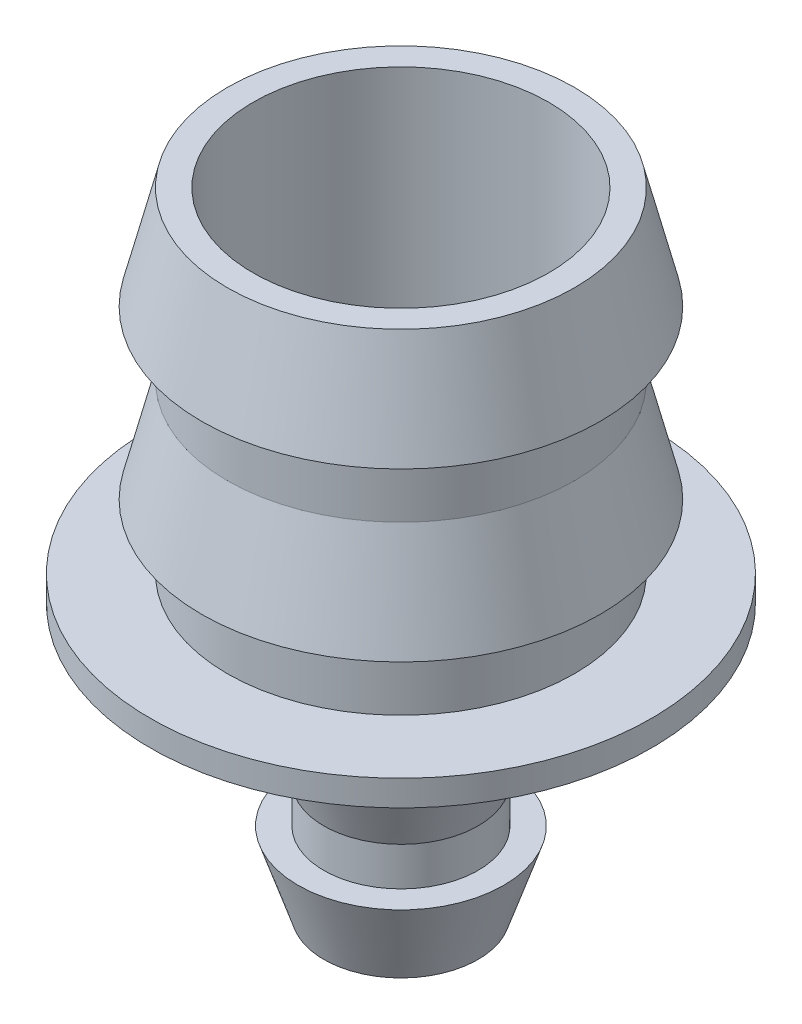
ISO-10303-21;
HEADER;
FILE_DESCRIPTION(('STEP AP214'),'2;1');
FILE_NAME('part.step','',(''),(''),'','','');
FILE_SCHEMA(('AUTOMOTIVE_DESIGN { 1 0 10303 214 1 1 1 1 }'));
ENDSEC;
DATA;
#1=APPLICATION_CONTEXT('core data for automotive mechanical design processes');
#2=APPLICATION_PROTOCOL_DEFINITION('international standard','automotive_design',2000,#1);
#3=PRODUCT_CONTEXT('',#1,'mechanical');
#4=PRODUCT('Part','Part','',(#3));
#5=PRODUCT_RELATED_PRODUCT_CATEGORY('part','',(#4));
#6=PRODUCT_DEFINITION_FORMATION('','',#4);
#7=PRODUCT_DEFINITION_CONTEXT('part definition',#1,'design');
#8=PRODUCT_DEFINITION('design','',#6,#7);
#9=PRODUCT_DEFINITION_SHAPE('','',#8);
#10=(LENGTH_UNIT() NAMED_UNIT(*) SI_UNIT(.MILLI.,.METRE.));
#11=(NAMED_UNIT(*) PLANE_ANGLE_UNIT() SI_UNIT($,.RADIAN.));
#12=(NAMED_UNIT(*) SI_UNIT($,.STERADIAN.) SOLID_ANGLE_UNIT());
#13=UNCERTAINTY_MEASURE_WITH_UNIT(LENGTH_MEASURE(1.E-05),#10,'distance_accuracy_value','');
#14=(GEOMETRIC_REPRESENTATION_CONTEXT(3) GLOBAL_UNCERTAINTY_ASSIGNED_CONTEXT((#13)) GLOBAL_UNIT_ASSIGNED_CONTEXT((#10,
#11,#12)) REPRESENTATION_CONTEXT('',''));
#15=CARTESIAN_POINT('',(0.,0.,0.));
#16=DIRECTION('',(0.,0.,1.));
#17=DIRECTION('',(1.,0.,0.));
#18=AXIS2_PLACEMENT_3D('',#15,#16,#17);
#19=CARTESIAN_POINT('',(-6.75,10.5,0.));
#20=DIRECTION('',(0.,-1.,0.));
#21=DIRECTION('',(0.,0.,-1.));
#22=AXIS2_PLACEMENT_3D('',#19,#20,#21);
#23=PLANE('',#22);
#24=CARTESIAN_POINT('',(0.,10.5,0.));
#25=DIRECTION('',(0.,-1.,0.));
#26=DIRECTION('',(0.,0.,-1.));
#27=AXIS2_PLACEMENT_3D('',#24,#25,#26);
#28=CIRCLE('',#27,6.75);
#29=CARTESIAN_POINT('',(0.,10.5,-6.75));
#30=VERTEX_POINT('',#29);
#31=EDGE_CURVE('E124',#30,#30,#28,.T.);
#32=ORIENTED_EDGE('',*,*,#31,.F.);
#33=EDGE_LOOP('',(#32));
#34=FACE_BOUND('',#33,.T.);
#35=CARTESIAN_POINT('',(0.,10.5,0.));
#36=DIRECTION('',(0.,-1.,0.));
#37=DIRECTION('',(0.,0.,-1.));
#38=AXIS2_PLACEMENT_3D('',#35,#36,#37);
#39=CIRCLE('',#38,5.75);
#40=CARTESIAN_POINT('',(0.,10.5,-5.75));
#41=VERTEX_POINT('',#40);
#42=EDGE_CURVE('E10',#41,#41,#39,.T.);
#43=ORIENTED_EDGE('',*,*,#42,.T.);
#44=EDGE_LOOP('',(#43));
#45=FACE_BOUND('',#44,.T.);
#46=ADVANCED_FACE('F37',(#34,#45),#23,.F.);
#47=CARTESIAN_POINT('',(0.,0.,0.));
#48=DIRECTION('',(0.,-1.,0.));
#49=DIRECTION('',(0.,0.,-1.));
#50=AXIS2_PLACEMENT_3D('',#47,#48,#49);
#51=CYLINDRICAL_SURFACE('',#50,5.75);
#52=ORIENTED_EDGE('',*,*,#42,.F.);
#53=EDGE_LOOP('',(#52));
#54=FACE_BOUND('',#53,.T.);
#55=CARTESIAN_POINT('',(0.,-2.5,0.));
#56=DIRECTION('',(0.,-1.,0.));
#57=DIRECTION('',(0.,0.,-1.));
#58=AXIS2_PLACEMENT_3D('',#55,#56,#57);
#59=CIRCLE('',#58,5.75);
#60=CARTESIAN_POINT('',(0.,-2.5,-5.75));
#61=VERTEX_POINT('',#60);
#62=EDGE_CURVE('E44',#61,#61,#59,.T.);
#63=ORIENTED_EDGE('',*,*,#62,.T.);
#64=EDGE_LOOP('',(#63));
#65=FACE_BOUND('',#64,.T.);
#66=ADVANCED_FACE('F132',(#54,#65),#51,.F.);
#67=CARTESIAN_POINT('',(0.,-3.5,0.));
#68=DIRECTION('',(0.,1.,0.));
#69=DIRECTION('',(0.,0.,1.));
#70=AXIS2_PLACEMENT_3D('',#67,#68,#69);
#71=CONICAL_SURFACE('',#70,2.,1.31019393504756);
#72=ORIENTED_EDGE('',*,*,#62,.F.);
#73=EDGE_LOOP('',(#72));
#74=FACE_BOUND('',#73,.T.);
#75=CARTESIAN_POINT('',(0.,-3.5,0.));
#76=DIRECTION('',(0.,-1.,0.));
#77=DIRECTION('',(0.,0.,-1.));
#78=AXIS2_PLACEMENT_3D('',#75,#76,#77);
#79=CIRCLE('',#78,2.);
#80=CARTESIAN_POINT('',(0.,-3.5,-2.));
#81=VERTEX_POINT('',#80);
#82=EDGE_CURVE('E49',#81,#81,#79,.T.);
#83=ORIENTED_EDGE('',*,*,#82,.T.);
#84=EDGE_LOOP('',(#83));
#85=FACE_BOUND('',#84,.T.);
#86=ADVANCED_FACE('F136',(#74,#85),#71,.F.);
#87=CARTESIAN_POINT('',(0.,0.,0.));
#88=DIRECTION('',(0.,-1.,0.));
#89=DIRECTION('',(0.,0.,-1.));
#90=AXIS2_PLACEMENT_3D('',#87,#88,#89);
#91=CYLINDRICAL_SURFACE('',#90,2.);
#92=ORIENTED_EDGE('',*,*,#82,.F.);
#93=EDGE_LOOP('',(#92));
#94=FACE_BOUND('',#93,.T.);
#95=CARTESIAN_POINT('',(0.,-14.,0.));
#96=DIRECTION('',(0.,-1.,0.));
#97=DIRECTION('',(0.,0.,-1.));
#98=AXIS2_PLACEMENT_3D('',#95,#96,#97);
#99=CIRCLE('',#98,2.);
#100=CARTESIAN_POINT('',(0.,-14.,-2.));
#101=VERTEX_POINT('',#100);
#102=EDGE_CURVE('E54',#101,#101,#99,.T.);
#103=ORIENTED_EDGE('',*,*,#102,.T.);
#104=EDGE_LOOP('',(#103));
#105=FACE_BOUND('',#104,.T.);
#106=ADVANCED_FACE('F141',(#94,#105),#91,.F.);
#107=CARTESIAN_POINT('',(-3.,-14.,0.));
#108=DIRECTION('',(0.,1.,0.));
#109=DIRECTION('',(0.,0.,1.));
#110=AXIS2_PLACEMENT_3D('',#107,#108,#109);
#111=PLANE('',#110);
#112=ORIENTED_EDGE('',*,*,#102,.F.);
#113=EDGE_LOOP('',(#112));
#114=FACE_BOUND('',#113,.T.);
#115=CARTESIAN_POINT('',(0.,-14.,0.));
#116=DIRECTION('',(0.,-1.,0.));
#117=DIRECTION('',(0.,0.,-1.));
#118=AXIS2_PLACEMENT_3D('',#115,#116,#117);
#119=CIRCLE('',#118,3.);
#120=CARTESIAN_POINT('',(0.,-14.,-3.));
#121=VERTEX_POINT('',#120);
#122=EDGE_CURVE('E60',#121,#121,#119,.T.);
#123=ORIENTED_EDGE('',*,*,#122,.T.);
#124=EDGE_LOOP('',(#123));
#125=FACE_BOUND('',#124,.T.);
#126=ADVANCED_FACE('F147',(#114,#125),#111,.F.);
#127=CARTESIAN_POINT('',(0.,-11.,0.));
#128=DIRECTION('',(0.,1.,0.));
#129=DIRECTION('',(0.,0.,1.));
#130=AXIS2_PLACEMENT_3D('',#127,#128,#129);
#131=CONICAL_SURFACE('',#130,4.,0.321750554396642);
#132=ORIENTED_EDGE('',*,*,#122,.F.);
#133=EDGE_LOOP('',(#132));
#134=FACE_BOUND('',#133,.T.);
#135=CARTESIAN_POINT('',(0.,-11.,0.));
#136=DIRECTION('',(0.,-1.,0.));
#137=DIRECTION('',(0.,0.,-1.));
#138=AXIS2_PLACEMENT_3D('',#135,#136,#137);
#139=CIRCLE('',#138,4.);
#140=CARTESIAN_POINT('',(0.,-11.,-4.));
#141=VERTEX_POINT('',#140);
#142=EDGE_CURVE('E64',#141,#141,#139,.T.);
#143=ORIENTED_EDGE('',*,*,#142,.T.);
#144=EDGE_LOOP('',(#143));
#145=FACE_BOUND('',#144,.T.);
#146=ADVANCED_FACE('F151',(#134,#145),#131,.T.);
#147=CARTESIAN_POINT('',(-3.,-11.,0.));
#148=DIRECTION('',(0.,-1.,0.));
#149=DIRECTION('',(0.,0.,-1.));
#150=AXIS2_PLACEMENT_3D('',#147,#148,#149);
#151=PLANE('',#150);
#152=ORIENTED_EDGE('',*,*,#142,.F.);
#153=EDGE_LOOP('',(#152));
#154=FACE_BOUND('',#153,.T.);
#155=CARTESIAN_POINT('',(0.,-11.,0.));
#156=DIRECTION('',(0.,-1.,0.));
#157=DIRECTION('',(0.,0.,-1.));
#158=AXIS2_PLACEMENT_3D('',#155,#156,#157);
#159=CIRCLE('',#158,3.);
#160=CARTESIAN_POINT('',(0.,-11.,-3.));
#161=VERTEX_POINT('',#160);
#162=EDGE_CURVE('E68',#161,#161,#159,.T.);
#163=ORIENTED_EDGE('',*,*,#162,.T.);
#164=EDGE_LOOP('',(#163));
#165=FACE_BOUND('',#164,.T.);
#166=ADVANCED_FACE('F155',(#154,#165),#151,.F.);
#167=CARTESIAN_POINT('',(0.,0.,0.));
#168=DIRECTION('',(0.,-1.,0.));
#169=DIRECTION('',(0.,0.,-1.));
#170=AXIS2_PLACEMENT_3D('',#167,#168,#169);
#171=CYLINDRICAL_SURFACE('',#170,3.);
#172=ORIENTED_EDGE('',*,*,#162,.F.);
#173=EDGE_LOOP('',(#172));
#174=FACE_BOUND('',#173,.T.);
#175=CARTESIAN_POINT('',(0.,-9.5,0.));
#176=DIRECTION('',(0.,-1.,0.));
#177=DIRECTION('',(0.,0.,-1.));
#178=AXIS2_PLACEMENT_3D('',#175,#176,#177);
#179=CIRCLE('',#178,3.);
#180=CARTESIAN_POINT('',(0.,-9.5,-3.));
#181=VERTEX_POINT('',#180);
#182=EDGE_CURVE('E72',#181,#181,#179,.T.);
#183=ORIENTED_EDGE('',*,*,#182,.T.);
#184=EDGE_LOOP('',(#183));
#185=FACE_BOUND('',#184,.T.);
#186=ADVANCED_FACE('F159',(#174,#185),#171,.T.);
#187=CARTESIAN_POINT('',(0.,-6.5,0.));
#188=DIRECTION('',(0.,1.,0.));
#189=DIRECTION('',(0.,0.,1.));
#190=AXIS2_PLACEMENT_3D('',#187,#188,#189);
#191=CONICAL_SURFACE('',#190,4.,0.321750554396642);
#192=ORIENTED_EDGE('',*,*,#182,.F.);
#193=EDGE_LOOP('',(#192));
#194=FACE_BOUND('',#193,.T.);
#195=CARTESIAN_POINT('',(0.,-6.5,0.));
#196=DIRECTION('',(0.,-1.,0.));
#197=DIRECTION('',(0.,0.,-1.));
#198=AXIS2_PLACEMENT_3D('',#195,#196,#197);
#199=CIRCLE('',#198,4.);
#200=CARTESIAN_POINT('',(0.,-6.5,-4.));
#201=VERTEX_POINT('',#200);
#202=EDGE_CURVE('E76',#201,#201,#199,.T.);
#203=ORIENTED_EDGE('',*,*,#202,.T.);
#204=EDGE_LOOP('',(#203));
#205=FACE_BOUND('',#204,.T.);
#206=ADVANCED_FACE('F163',(#194,#205),#191,.T.);
#207=CARTESIAN_POINT('',(-3.,-6.5,0.));
#208=DIRECTION('',(0.,-1.,0.));
#209=DIRECTION('',(0.,0.,-1.));
#210=AXIS2_PLACEMENT_3D('',#207,#208,#209);
#211=PLANE('',#210);
#212=ORIENTED_EDGE('',*,*,#202,.F.);
#213=EDGE_LOOP('',(#212));
#214=FACE_BOUND('',#213,.T.);
#215=CARTESIAN_POINT('',(0.,-6.5,0.));
#216=DIRECTION('',(0.,-1.,0.));
#217=DIRECTION('',(0.,0.,-1.));
#218=AXIS2_PLACEMENT_3D('',#215,#216,#217);
#219=CIRCLE('',#218,3.);
#220=CARTESIAN_POINT('',(0.,-6.5,-3.));
#221=VERTEX_POINT('',#220);
#222=EDGE_CURVE('E80',#221,#221,#219,.T.);
#223=ORIENTED_EDGE('',*,*,#222,.T.);
#224=EDGE_LOOP('',(#223));
#225=FACE_BOUND('',#224,.T.);
#226=ADVANCED_FACE('F167',(#214,#225),#211,.F.);
#227=CARTESIAN_POINT('',(0.,0.,0.));
#228=DIRECTION('',(0.,-1.,0.));
#229=DIRECTION('',(0.,0.,-1.));
#230=AXIS2_PLACEMENT_3D('',#227,#228,#229);
#231=CYLINDRICAL_SURFACE('',#230,3.);
#232=ORIENTED_EDGE('',*,*,#222,.F.);
#233=EDGE_LOOP('',(#232));
#234=FACE_BOUND('',#233,.T.);
#235=CARTESIAN_POINT('',(0.,-4.5,0.));
#236=DIRECTION('',(0.,-1.,0.));
#237=DIRECTION('',(0.,0.,-1.));
#238=AXIS2_PLACEMENT_3D('',#235,#236,#237);
#239=CIRCLE('',#238,3.);
#240=CARTESIAN_POINT('',(0.,-4.5,-3.));
#241=VERTEX_POINT('',#240);
#242=EDGE_CURVE('E84',#241,#241,#239,.T.);
#243=ORIENTED_EDGE('',*,*,#242,.T.);
#244=EDGE_LOOP('',(#243));
#245=FACE_BOUND('',#244,.T.);
#246=ADVANCED_FACE('F171',(#234,#245),#231,.T.);
#247=CARTESIAN_POINT('',(0.,-3.5,0.));
#248=DIRECTION('',(0.,1.,0.));
#249=DIRECTION('',(0.,0.,1.));
#250=AXIS2_PLACEMENT_3D('',#247,#248,#249);
#251=CONICAL_SURFACE('',#250,6.75,1.31019393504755);
#252=ORIENTED_EDGE('',*,*,#242,.F.);
#253=EDGE_LOOP('',(#252));
#254=FACE_BOUND('',#253,.T.);
#255=CARTESIAN_POINT('',(0.,-3.5,0.));
#256=DIRECTION('',(0.,-1.,0.));
#257=DIRECTION('',(0.,0.,-1.));
#258=AXIS2_PLACEMENT_3D('',#255,#256,#257);
#259=CIRCLE('',#258,6.75);
#260=CARTESIAN_POINT('',(0.,-3.5,-6.75));
#261=VERTEX_POINT('',#260);
#262=EDGE_CURVE('E88',#261,#261,#259,.T.);
#263=ORIENTED_EDGE('',*,*,#262,.T.);
#264=EDGE_LOOP('',(#263));
#265=FACE_BOUND('',#264,.T.);
#266=ADVANCED_FACE('F175',(#254,#265),#251,.T.);
#267=CARTESIAN_POINT('',(-9.75,-3.5,0.));
#268=DIRECTION('',(0.,1.,0.));
#269=DIRECTION('',(0.,0.,1.));
#270=AXIS2_PLACEMENT_3D('',#267,#268,#269);
#271=PLANE('',#270);
#272=ORIENTED_EDGE('',*,*,#262,.F.);
#273=EDGE_LOOP('',(#272));
#274=FACE_BOUND('',#273,.T.);
#275=CARTESIAN_POINT('',(0.,-3.5,0.));
#276=DIRECTION('',(0.,-1.,0.));
#277=DIRECTION('',(0.,0.,-1.));
#278=AXIS2_PLACEMENT_3D('',#275,#276,#277);
#279=CIRCLE('',#278,9.75);
#280=CARTESIAN_POINT('',(0.,-3.5,-9.75));
#281=VERTEX_POINT('',#280);
#282=EDGE_CURVE('E92',#281,#281,#279,.T.);
#283=ORIENTED_EDGE('',*,*,#282,.T.);
#284=EDGE_LOOP('',(#283));
#285=FACE_BOUND('',#284,.T.);
#286=ADVANCED_FACE('F179',(#274,#285),#271,.F.);
#287=CARTESIAN_POINT('',(0.,0.,0.));
#288=DIRECTION('',(0.,-1.,0.));
#289=DIRECTION('',(0.,0.,-1.));
#290=AXIS2_PLACEMENT_3D('',#287,#288,#289);
#291=CYLINDRICAL_SURFACE('',#290,9.75);
#292=ORIENTED_EDGE('',*,*,#282,.F.);
#293=EDGE_LOOP('',(#292));
#294=FACE_BOUND('',#293,.T.);
#295=CARTESIAN_POINT('',(0.,-2.5,0.));
#296=DIRECTION('',(0.,-1.,0.));
#297=DIRECTION('',(0.,0.,-1.));
#298=AXIS2_PLACEMENT_3D('',#295,#296,#297);
#299=CIRCLE('',#298,9.75);
#300=CARTESIAN_POINT('',(0.,-2.5,-9.75));
#301=VERTEX_POINT('',#300);
#302=EDGE_CURVE('E96',#301,#301,#299,.T.);
#303=ORIENTED_EDGE('',*,*,#302,.T.);
#304=EDGE_LOOP('',(#303));
#305=FACE_BOUND('',#304,.T.);
#306=ADVANCED_FACE('F183',(#294,#305),#291,.T.);
#307=CARTESIAN_POINT('',(-6.75,-2.5,0.));
#308=DIRECTION('',(0.,-1.,0.));
#309=DIRECTION('',(0.,0.,-1.));
#310=AXIS2_PLACEMENT_3D('',#307,#308,#309);
#311=PLANE('',#310);
#312=ORIENTED_EDGE('',*,*,#302,.F.);
#313=EDGE_LOOP('',(#312));
#314=FACE_BOUND('',#313,.T.);
#315=CARTESIAN_POINT('',(0.,-2.5,0.));
#316=DIRECTION('',(0.,-1.,0.));
#317=DIRECTION('',(0.,0.,-1.));
#318=AXIS2_PLACEMENT_3D('',#315,#316,#317);
#319=CIRCLE('',#318,6.75);
#320=CARTESIAN_POINT('',(0.,-2.5,-6.75));
#321=VERTEX_POINT('',#320);
#322=EDGE_CURVE('E100',#321,#321,#319,.T.);
#323=ORIENTED_EDGE('',*,*,#322,.T.);
#324=EDGE_LOOP('',(#323));
#325=FACE_BOUND('',#324,.T.);
#326=ADVANCED_FACE('F187',(#314,#325),#311,.F.);
#327=CARTESIAN_POINT('',(0.,0.,0.));
#328=DIRECTION('',(0.,-1.,0.));
#329=DIRECTION('',(0.,0.,-1.));
#330=AXIS2_PLACEMENT_3D('',#327,#328,#329);
#331=CYLINDRICAL_SURFACE('',#330,6.75);
#332=ORIENTED_EDGE('',*,*,#322,.F.);
#333=EDGE_LOOP('',(#332));
#334=FACE_BOUND('',#333,.T.);
#335=CARTESIAN_POINT('',(0.,0.,0.));
#336=DIRECTION('',(0.,-1.,0.));
#337=DIRECTION('',(0.,0.,-1.));
#338=AXIS2_PLACEMENT_3D('',#335,#336,#337);
#339=CIRCLE('',#338,6.75);
#340=CARTESIAN_POINT('',(0.,0.,-6.75));
#341=VERTEX_POINT('',#340);
#342=EDGE_CURVE('E104',#341,#341,#339,.T.);
#343=ORIENTED_EDGE('',*,*,#342,.T.);
#344=EDGE_LOOP('',(#343));
#345=FACE_BOUND('',#344,.T.);
#346=ADVANCED_FACE('F191',(#334,#345),#331,.T.);
#347=CARTESIAN_POINT('',(-7.75,0.,0.));
#348=DIRECTION('',(0.,1.,0.));
#349=DIRECTION('',(0.,0.,1.));
#350=AXIS2_PLACEMENT_3D('',#347,#348,#349);
#351=PLANE('',#350);
#352=ORIENTED_EDGE('',*,*,#342,.F.);
#353=EDGE_LOOP('',(#352));
#354=FACE_BOUND('',#353,.T.);
#355=CARTESIAN_POINT('',(0.,0.,0.));
#356=DIRECTION('',(0.,-1.,0.));
#357=DIRECTION('',(0.,0.,-1.));
#358=AXIS2_PLACEMENT_3D('',#355,#356,#357);
#359=CIRCLE('',#358,7.75);
#360=CARTESIAN_POINT('',(0.,0.,-7.75));
#361=VERTEX_POINT('',#360);
#362=EDGE_CURVE('E108',#361,#361,#359,.T.);
#363=ORIENTED_EDGE('',*,*,#362,.T.);
#364=EDGE_LOOP('',(#363));
#365=FACE_BOUND('',#364,.T.);
#366=ADVANCED_FACE('F195',(#354,#365),#351,.F.);
#367=CARTESIAN_POINT('',(0.,4.,0.));
#368=DIRECTION('',(0.,-1.,0.));
#369=DIRECTION('',(0.,0.,-1.));
#370=AXIS2_PLACEMENT_3D('',#367,#368,#369);
#371=CONICAL_SURFACE('',#370,6.75,0.244978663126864);
#372=ORIENTED_EDGE('',*,*,#362,.F.);
#373=EDGE_LOOP('',(#372));
#374=FACE_BOUND('',#373,.T.);
#375=CARTESIAN_POINT('',(0.,4.,0.));
#376=DIRECTION('',(0.,-1.,0.));
#377=DIRECTION('',(0.,0.,-1.));
#378=AXIS2_PLACEMENT_3D('',#375,#376,#377);
#379=CIRCLE('',#378,6.75);
#380=CARTESIAN_POINT('',(0.,4.,-6.75));
#381=VERTEX_POINT('',#380);
#382=EDGE_CURVE('E112',#381,#381,#379,.T.);
#383=ORIENTED_EDGE('',*,*,#382,.T.);
#384=EDGE_LOOP('',(#383));
#385=FACE_BOUND('',#384,.T.);
#386=ADVANCED_FACE('F199',(#374,#385),#371,.T.);
#387=CARTESIAN_POINT('',(0.,0.,0.));
#388=DIRECTION('',(0.,-1.,0.));
#389=DIRECTION('',(0.,0.,-1.));
#390=AXIS2_PLACEMENT_3D('',#387,#388,#389);
#391=CYLINDRICAL_SURFACE('',#390,6.75);
#392=ORIENTED_EDGE('',*,*,#382,.F.);
#393=EDGE_LOOP('',(#392));
#394=FACE_BOUND('',#393,.T.);
#395=CARTESIAN_POINT('',(0.,6.5,0.));
#396=DIRECTION('',(0.,-1.,0.));
#397=DIRECTION('',(0.,0.,-1.));
#398=AXIS2_PLACEMENT_3D('',#395,#396,#397);
#399=CIRCLE('',#398,6.75);
#400=CARTESIAN_POINT('',(0.,6.5,-6.75));
#401=VERTEX_POINT('',#400);
#402=EDGE_CURVE('E116',#401,#401,#399,.T.);
#403=ORIENTED_EDGE('',*,*,#402,.T.);
#404=EDGE_LOOP('',(#403));
#405=FACE_BOUND('',#404,.T.);
#406=ADVANCED_FACE('F203',(#394,#405),#391,.T.);
#407=CARTESIAN_POINT('',(-7.75,6.5,0.));
#408=DIRECTION('',(0.,1.,0.));
#409=DIRECTION('',(0.,0.,1.));
#410=AXIS2_PLACEMENT_3D('',#407,#408,#409);
#411=PLANE('',#410);
#412=ORIENTED_EDGE('',*,*,#402,.F.);
#413=EDGE_LOOP('',(#412));
#414=FACE_BOUND('',#413,.T.);
#415=CARTESIAN_POINT('',(0.,6.5,0.));
#416=DIRECTION('',(0.,-1.,0.));
#417=DIRECTION('',(0.,0.,-1.));
#418=AXIS2_PLACEMENT_3D('',#415,#416,#417);
#419=CIRCLE('',#418,7.75);
#420=CARTESIAN_POINT('',(0.,6.5,-7.75));
#421=VERTEX_POINT('',#420);
#422=EDGE_CURVE('E120',#421,#421,#419,.T.);
#423=ORIENTED_EDGE('',*,*,#422,.T.);
#424=EDGE_LOOP('',(#423));
#425=FACE_BOUND('',#424,.T.);
#426=ADVANCED_FACE('F207',(#414,#425),#411,.F.);
#427=CARTESIAN_POINT('',(0.,10.5,0.));
#428=DIRECTION('',(0.,-1.,0.));
#429=DIRECTION('',(0.,0.,-1.));
#430=AXIS2_PLACEMENT_3D('',#427,#428,#429);
#431=CONICAL_SURFACE('',#430,6.75,0.244978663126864);
#432=ORIENTED_EDGE('',*,*,#422,.F.);
#433=EDGE_LOOP('',(#432));
#434=FACE_BOUND('',#433,.T.);
#435=ORIENTED_EDGE('',*,*,#31,.T.);
#436=EDGE_LOOP('',(#435));
#437=FACE_BOUND('',#436,.T.);
#438=ADVANCED_FACE('F129',(#434,#437),#431,.T.);
#439=CLOSED_SHELL('',(#46,#66,#86,#106,#126,#146,#166,#186,#206,#226,#246,#266,#286,#306,#326,
#346,#366,#386,#406,#426,#438));
#440=MANIFOLD_SOLID_BREP('B2',#439);
#441=ADVANCED_BREP_SHAPE_REPRESENTATION('',(#18,#440),#14);
#442=SHAPE_DEFINITION_REPRESENTATION(#9,#441);
ENDSEC;
END-ISO-10303-21;
